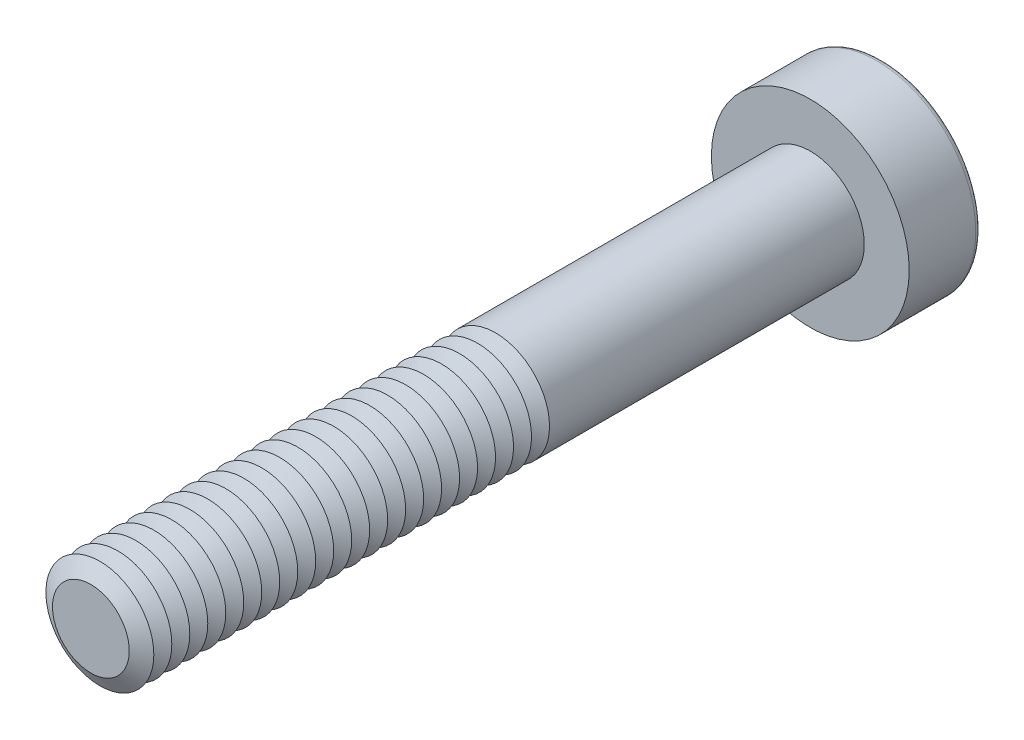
from build123d import *

# Parameters (mm, degrees)
SKETCH1_R           = 1.5
BOSS_EXTRUDE1_DEPTH = 20
SKETCH2_R           = 2.75
BOSS_EXTRUDE2_DEPTH = 2
CUT_EXTRUDE1_DEPTH  = 1.5
FILLET1_R           = 0.15
LPATTERN1_COUNT     = 23
LPATTERN1_PITCH     = 0.5


with BuildPart() as part:
    # Sketch1 → Boss-Extrude1 (new body)
    with BuildSketch(Plane.XY):
        Circle(SKETCH1_R)
    extrude(amount=BOSS_EXTRUDE1_DEPTH)

    # Sketch2 → Boss-Extrude2 (add)
    with BuildSketch(Plane(origin=(0, 0, 0), x_dir=(-1, 0, 0), z_dir=(0, 0, -1))):
        Circle(SKETCH2_R)
    extrude(amount=BOSS_EXTRUDE2_DEPTH)

    # Sketch3 → Cut-Extrude1 (cut)
    with BuildSketch(Plane(origin=(0, 0, -2), x_dir=(-1, 0, 0), z_dir=(0, 0, -1))):
        Polygon((-0.577350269, 1), (-1.154700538, 0), (-0.577350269, -1), (0.577350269, -1), (1.154700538, 0), (0.577350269, 1), align=None)
    extrude(amount=-CUT_EXTRUDE1_DEPTH, mode=Mode.SUBTRACT)

    # Fillet1
    fillet1_edges = [part.edges().sort_by_distance(p)[0] for p in [
        (2.75, 0, -2),
    ]]
    fillet(fillet1_edges, radius=FILLET1_R)

    # Cut-Extrude2 cone 1 section (on through the dimple's axis) → Cut-Extrude2 (revolve, cut)
    with BuildSketch(Plane(origin=(0, 0, -0.5), x_dir=(0, 1, 0), z_dir=(1, 0, 0))):
        Polygon((0, 0), (1, 0), (0, 0.577350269), align=None)
    revolve(axis=Axis((0, 0, -0.5), (0, 0, 1)), mode=Mode.SUBTRACT)

    # Cut-Extrude3 cone 1 section (on through the dimple's axis) → Cut-Extrude3 (revolve, cut)
    with BuildSketch(Plane(origin=(0, 0, -2), x_dir=(0, 1, 0), z_dir=(1, 0, 0))):
        Polygon((0, 0), (1.154700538, 0), (0, 0.309401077), align=None)
    revolve(axis=Axis((0, 0, -2), (0, 0, 1)), mode=Mode.SUBTRACT)

    # Sketch7 → Cut-Revolve1 (revolve, cut)
    with BuildSketch(Plane(origin=(0, 0, 0), x_dir=(0, 0, -1), z_dir=(1, 0, 0)), mode=Mode.PRIVATE) as cut_revolve1_sk:
        Polygon((-20, 1.066987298), (-19.75, 1.5), (-20.25, 1.5), align=None)
    cut_revolve1 = revolve(cut_revolve1_sk.sketch.rotate(Axis((0, 0, 20), (0, 0, -1)), 90), axis=Axis((0, 0, 20), (0, 0, -1)), mode=Mode.SUBTRACT)

    # LPattern1: Cut-Revolve1 ×23
    with Locations(*[(0, 0, -i * LPATTERN1_PITCH) for i in range(1, LPATTERN1_COUNT)]):
        add(cut_revolve1, mode=Mode.SUBTRACT)


solid = part.part
